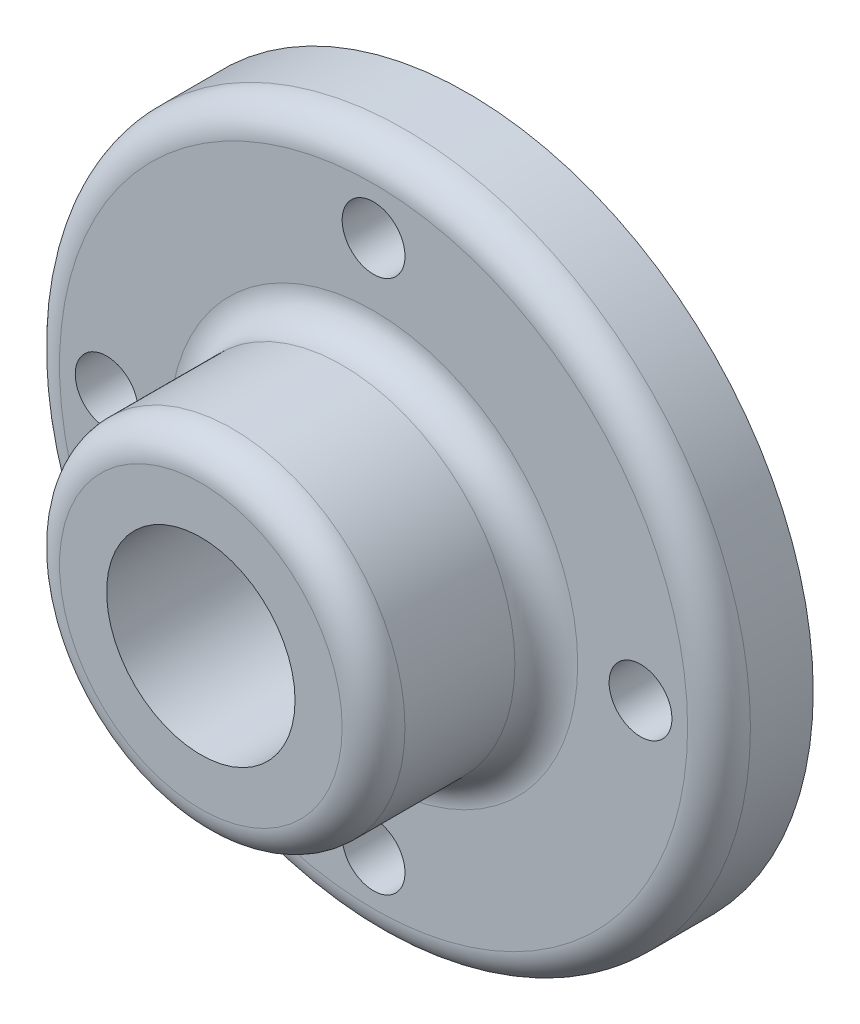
from build123d import *

# Parameters (mm, degrees)
SKETCH2_R          = 19.05
CUT_EXTRUDE1_DEPTH = 113.567071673
FILLET1_R          = 6.35
SKETCH3_R          = 6.35
CUT_EXTRUDE2_DEPTH = 105.775000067
CIRPATTERN1_COUNT  = 4


with BuildPart() as part:
    # Sketch1 → Revolve1 (revolve)
    with BuildSketch(Plane(origin=(0, 0, 0), x_dir=(1, 0, 0), z_dir=(0, 1, 0))):
        Polygon((0, 0), (69.85, 0), (69.85, -19.05), (34.925, -19.05), (34.925, -53.975), (0, -53.975), align=None)
    revolve(axis=Axis((0, 0, 0), (0, 0, -1)))

    # Sketch2 → Cut-Extrude1 (cut, through all)
    with BuildSketch(Plane.XY.offset(53.975)):
        Circle(SKETCH2_R)
    extrude(amount=-CUT_EXTRUDE1_DEPTH, mode=Mode.SUBTRACT)

    # Fillet1
    fillet1_edges = [part.edges().sort_by_distance(p)[0] for p in [
        (-34.925, 0, 53.975),
        (-34.925, 0, 19.05),
        (-69.85, 0, 19.05),
    ]]
    fillet(fillet1_edges, radius=FILLET1_R)

    # Sketch3 → Cut-Extrude2 (cut, through all)
    with BuildSketch(Plane.XY.offset(19.05)):
        with Locations((0, 53.975)):
            Circle(SKETCH3_R)
    cut_extrude2 = extrude(amount=-CUT_EXTRUDE2_DEPTH, mode=Mode.SUBTRACT)

    # CirPattern1: Cut-Extrude2 ×4 about axis
    cirpattern1_axis = Axis((0, 0, 0), (0, 0, 1))
    for i in range(1, CIRPATTERN1_COUNT):
        add(cut_extrude2.rotate(cirpattern1_axis, i * 360 / CIRPATTERN1_COUNT), mode=Mode.SUBTRACT)


solid = part.part
